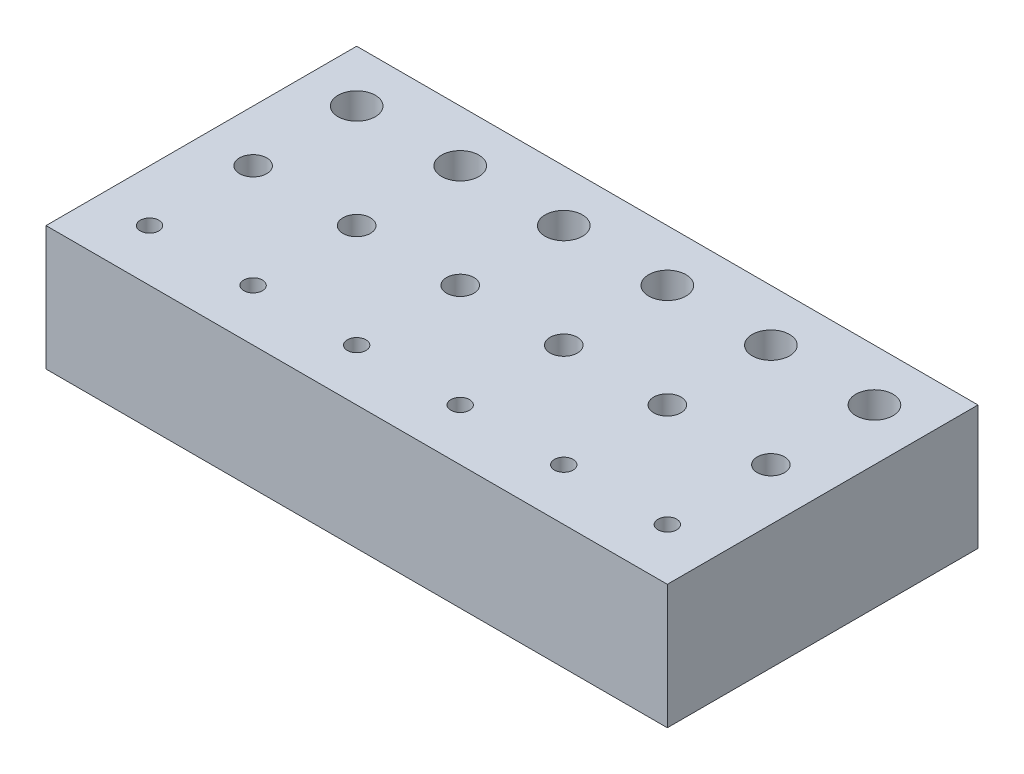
from build123d import *

# Parameters (mm, degrees)
SKETCH1_W            = 150
SKETCH1_H            = 30
BOSS_EXTRUDE1_DEPTH  = 37.5
M8_CLEARANCE_HOLE1_D = 9
LPATTERN1_COUNT      = 6
LPATTERN1_PITCH      = 25
M6_CLEARANCE_HOLE1_D = 6.6
LPATTERN2_COUNT      = 6
LPATTERN2_PITCH      = 25
M4_CLEARANCE_HOLE1_D = 4.5
LPATTERN3_COUNT      = 6
LPATTERN3_PITCH      = 25


with BuildPart() as part:
    # Sketch1 → Boss-Extrude1 (new, symmetric)
    with BuildSketch(Plane.XY):
        Rectangle(SKETCH1_W, SKETCH1_H)
    extrude(amount=BOSS_EXTRUDE1_DEPTH, both=True)

    # M8 Clearance Hole1 (through all)
    with Locations(Plane(origin=(0, 15, 0), x_dir=(1, 0, 0), z_dir=(0, 1, 0))):
        with Locations((-62.5, 25)):
            m8_clearance_hole1 = Hole(M8_CLEARANCE_HOLE1_D / 2)

    # LPattern1: M8 Clearance Hole1 ×6
    with Locations(*[(i * LPATTERN1_PITCH, 0, 0) for i in range(1, LPATTERN1_COUNT)]):
        add(m8_clearance_hole1, mode=Mode.SUBTRACT)

    # M6 Clearance Hole1 (through all)
    with Locations(Plane(origin=(0, 15, 0), x_dir=(1, 0, 0), z_dir=(0, 1, 0))):
        with Locations((-62.5, 0)):
            m6_clearance_hole1 = Hole(M6_CLEARANCE_HOLE1_D / 2)

    # LPattern2: M6 Clearance Hole1 ×6
    with Locations(*[(i * LPATTERN2_PITCH, 0, 0) for i in range(1, LPATTERN2_COUNT)]):
        add(m6_clearance_hole1, mode=Mode.SUBTRACT)

    # M4 Clearance Hole1 (through all)
    with Locations(Plane(origin=(0, 15, 0), x_dir=(1, 0, 0), z_dir=(0, 1, 0))):
        with Locations((-62.5, -25)):
            m4_clearance_hole1 = Hole(M4_CLEARANCE_HOLE1_D / 2)

    # LPattern3: M4 Clearance Hole1 ×6
    with Locations(*[(i * LPATTERN3_PITCH, 0, 0) for i in range(1, LPATTERN3_COUNT)]):
        add(m4_clearance_hole1, mode=Mode.SUBTRACT)


solid = part.part
